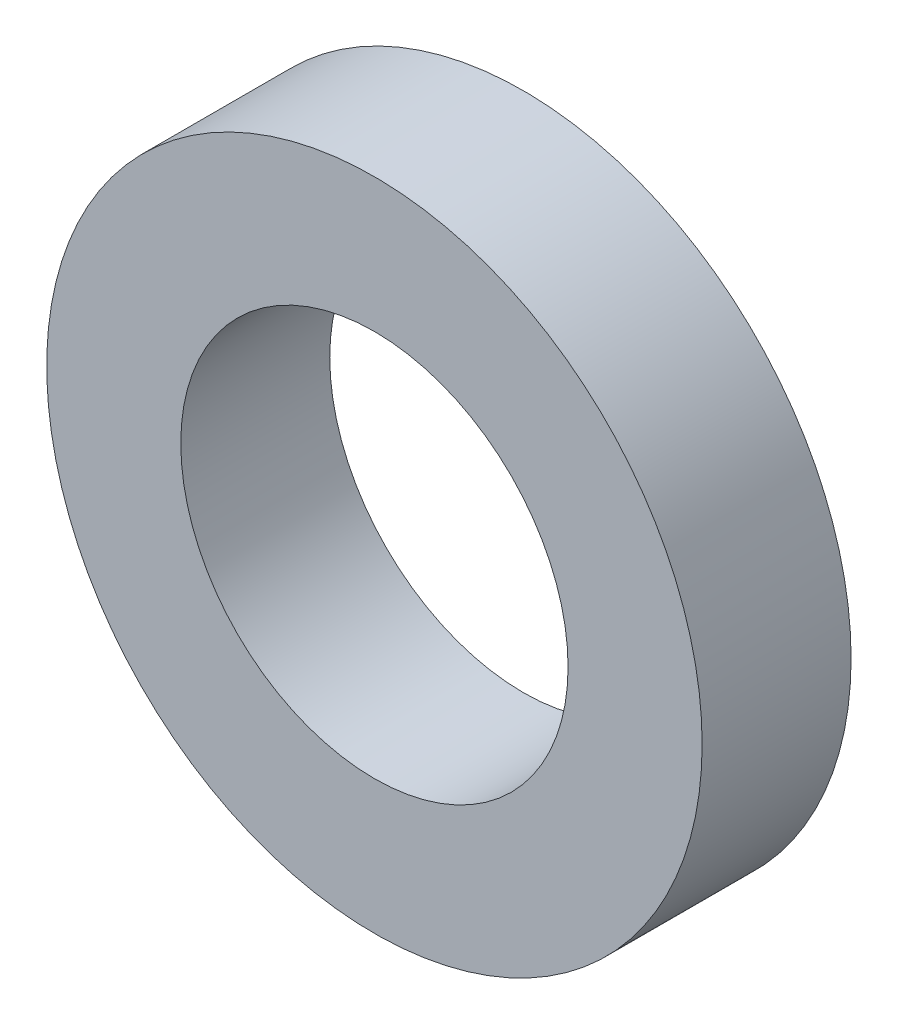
from build123d import *

# Parameters (mm, degrees)
ESQUISSE2_R        = 11
ESQUISSE2_R_2      = 6.5
BOSS_EXTRU_1_DEPTH = 5


with BuildPart() as part:
    # Esquisse2 → Boss.-Extru.1 (new body)
    with BuildSketch(Plane.XY):
        Circle(ESQUISSE2_R)
        Circle(ESQUISSE2_R_2, mode=Mode.SUBTRACT)
    extrude(amount=BOSS_EXTRU_1_DEPTH)


solid = part.part
